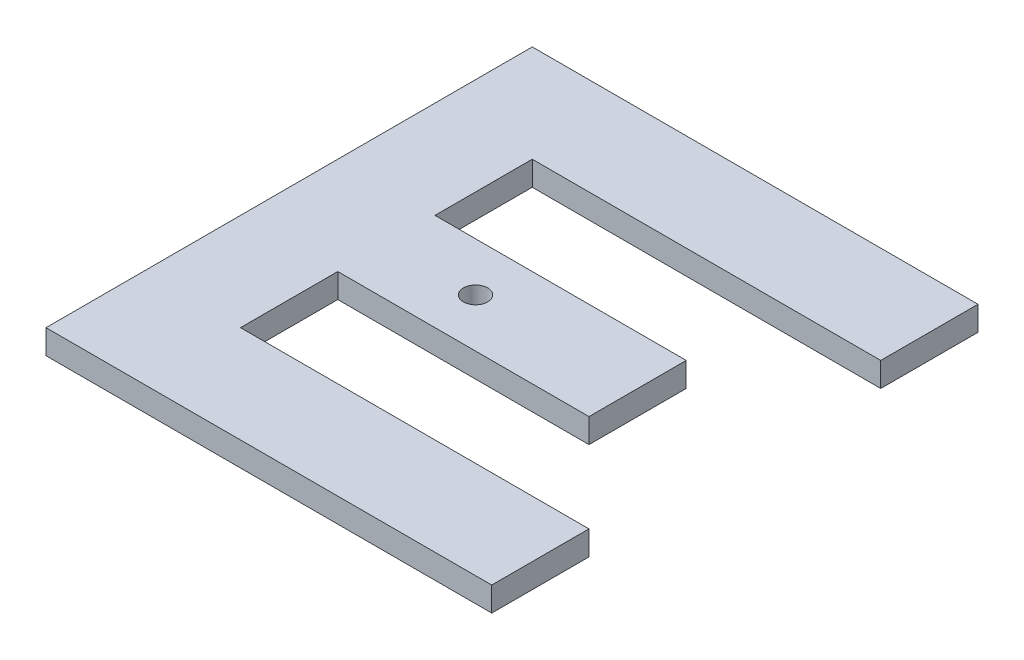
from build123d import *

# Parameters (mm, degrees)
SKETCH1_R      = 1.5
EXTRUDE1_DEPTH = 3


with BuildPart() as part:
    # Sketch1 → Extrude1 (new body)
    with BuildSketch(Plane(origin=(0, 0, 0), x_dir=(1, 0, 0), z_dir=(0, 1, 0))):
        Polygon((12, 48), (55, 48), (55, 60), (0, 60), (0, 0), (55, 0), (55, 12), (12, 12), (12, 24), (43, 24), (43, 36), (12, 36), align=None)
        with Locations(Location((23, 30, 0), (0, 0, 270))):
            Circle(SKETCH1_R, mode=Mode.SUBTRACT)
    extrude(amount=EXTRUDE1_DEPTH)


solid = part.part
